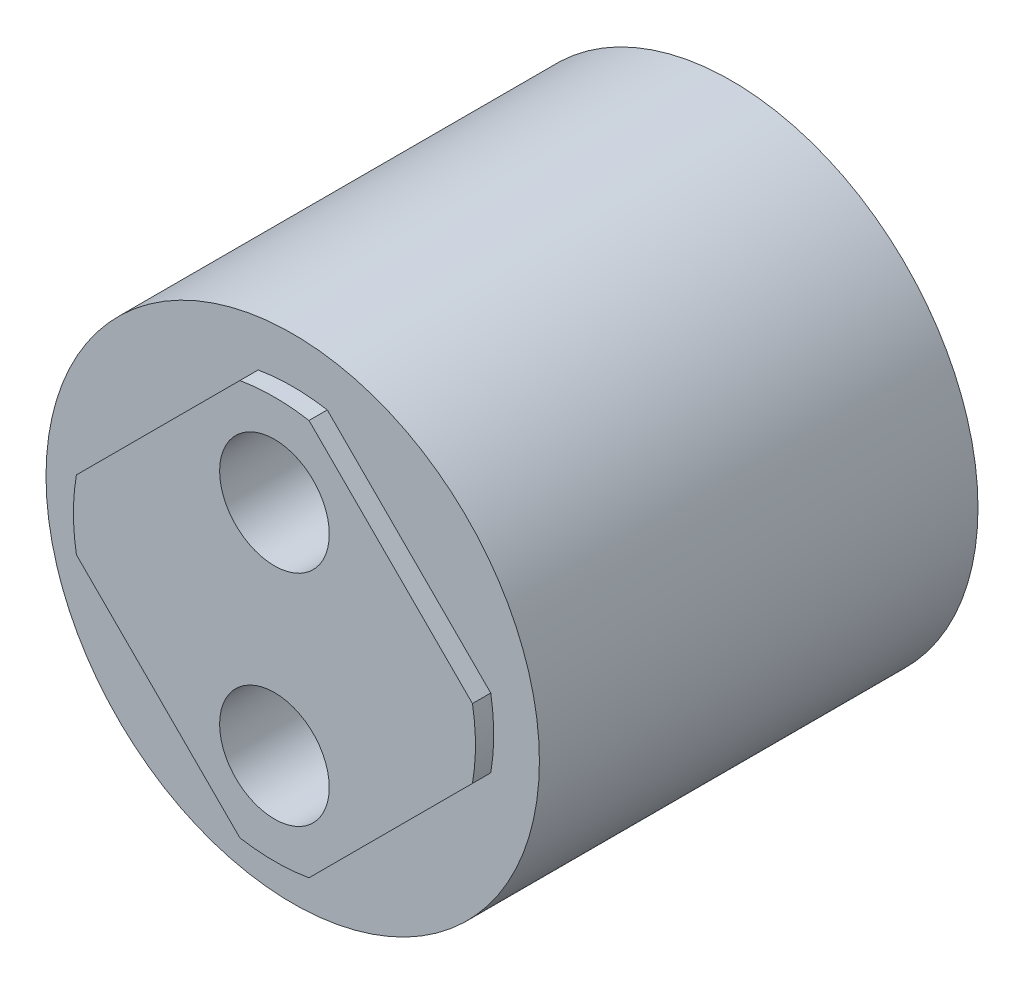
ISO-10303-21;
HEADER;
FILE_DESCRIPTION(('STEP AP214'),'2;1');
FILE_NAME('part.step','',(''),(''),'','','');
FILE_SCHEMA(('AUTOMOTIVE_DESIGN { 1 0 10303 214 1 1 1 1 }'));
ENDSEC;
DATA;
#1=APPLICATION_CONTEXT('core data for automotive mechanical design processes');
#2=APPLICATION_PROTOCOL_DEFINITION('international standard','automotive_design',2000,#1);
#3=PRODUCT_CONTEXT('',#1,'mechanical');
#4=PRODUCT('Part','Part','',(#3));
#5=PRODUCT_RELATED_PRODUCT_CATEGORY('part','',(#4));
#6=PRODUCT_DEFINITION_FORMATION('','',#4);
#7=PRODUCT_DEFINITION_CONTEXT('part definition',#1,'design');
#8=PRODUCT_DEFINITION('design','',#6,#7);
#9=PRODUCT_DEFINITION_SHAPE('','',#8);
#10=(LENGTH_UNIT() NAMED_UNIT(*) SI_UNIT(.MILLI.,.METRE.));
#11=(NAMED_UNIT(*) PLANE_ANGLE_UNIT() SI_UNIT($,.RADIAN.));
#12=(NAMED_UNIT(*) SI_UNIT($,.STERADIAN.) SOLID_ANGLE_UNIT());
#13=UNCERTAINTY_MEASURE_WITH_UNIT(LENGTH_MEASURE(1.E-05),#10,'distance_accuracy_value','');
#14=(GEOMETRIC_REPRESENTATION_CONTEXT(3) GLOBAL_UNCERTAINTY_ASSIGNED_CONTEXT((#13)) GLOBAL_UNIT_ASSIGNED_CONTEXT((#10,
#11,#12)) REPRESENTATION_CONTEXT('',''));
#15=CARTESIAN_POINT('',(0.,0.,0.));
#16=DIRECTION('',(0.,0.,1.));
#17=DIRECTION('',(1.,0.,0.));
#18=AXIS2_PLACEMENT_3D('',#15,#16,#17);
#19=CARTESIAN_POINT('',(0.,6.,24.));
#20=DIRECTION('',(0.,0.,-1.));
#21=DIRECTION('',(1.,0.,0.));
#22=AXIS2_PLACEMENT_3D('',#19,#20,#21);
#23=CYLINDRICAL_SURFACE('',#22,3.);
#24=CARTESIAN_POINT('',(0.,6.,25.));
#25=DIRECTION('',(0.,0.,1.));
#26=DIRECTION('',(-1.,0.,0.));
#27=AXIS2_PLACEMENT_3D('',#24,#25,#26);
#28=CIRCLE('',#27,3.);
#29=CARTESIAN_POINT('',(-3.,6.,25.));
#30=VERTEX_POINT('',#29);
#31=EDGE_CURVE('E165',#30,#30,#28,.T.);
#32=ORIENTED_EDGE('',*,*,#31,.T.);
#33=EDGE_LOOP('',(#32));
#34=FACE_BOUND('',#33,.T.);
#35=CARTESIAN_POINT('',(0.,6.,10.));
#36=DIRECTION('',(0.,0.,-1.));
#37=DIRECTION('',(1.,0.,0.));
#38=AXIS2_PLACEMENT_3D('',#35,#36,#37);
#39=CIRCLE('',#38,3.);
#40=CARTESIAN_POINT('',(3.,6.,10.));
#41=VERTEX_POINT('',#40);
#42=EDGE_CURVE('E9',#41,#41,#39,.F.);
#43=ORIENTED_EDGE('',*,*,#42,.F.);
#44=EDGE_LOOP('',(#43));
#45=FACE_BOUND('',#44,.T.);
#46=ADVANCED_FACE('F14',(#34,#45),#23,.F.);
#47=CARTESIAN_POINT('',(0.,-6.,24.));
#48=DIRECTION('',(0.,0.,-1.));
#49=DIRECTION('',(1.,0.,0.));
#50=AXIS2_PLACEMENT_3D('',#47,#48,#49);
#51=CYLINDRICAL_SURFACE('',#50,3.);
#52=CARTESIAN_POINT('',(0.,-6.,25.));
#53=DIRECTION('',(0.,0.,1.));
#54=DIRECTION('',(-1.,0.,0.));
#55=AXIS2_PLACEMENT_3D('',#52,#53,#54);
#56=CIRCLE('',#55,3.);
#57=CARTESIAN_POINT('',(-3.,-6.,25.));
#58=VERTEX_POINT('',#57);
#59=EDGE_CURVE('E161',#58,#58,#56,.T.);
#60=ORIENTED_EDGE('',*,*,#59,.T.);
#61=EDGE_LOOP('',(#60));
#62=FACE_BOUND('',#61,.T.);
#63=CARTESIAN_POINT('',(0.,-6.,10.));
#64=DIRECTION('',(0.,0.,-1.));
#65=DIRECTION('',(1.,0.,0.));
#66=AXIS2_PLACEMENT_3D('',#63,#64,#65);
#67=CIRCLE('',#66,3.);
#68=CARTESIAN_POINT('',(3.,-6.,10.));
#69=VERTEX_POINT('',#68);
#70=EDGE_CURVE('E24',#69,#69,#67,.F.);
#71=ORIENTED_EDGE('',*,*,#70,.F.);
#72=EDGE_LOOP('',(#71));
#73=FACE_BOUND('',#72,.T.);
#74=ADVANCED_FACE('F221',(#62,#73),#51,.F.);
#75=CARTESIAN_POINT('',(0.,0.,24.));
#76=DIRECTION('',(0.,0.,-1.));
#77=DIRECTION('',(1.,0.,0.));
#78=AXIS2_PLACEMENT_3D('',#75,#76,#77);
#79=CYLINDRICAL_SURFACE('',#78,13.5);
#80=CARTESIAN_POINT('',(0.,0.,0.));
#81=DIRECTION('',(0.,0.,-1.));
#82=DIRECTION('',(1.,0.,0.));
#83=AXIS2_PLACEMENT_3D('',#80,#81,#82);
#84=CIRCLE('',#83,13.5);
#85=CARTESIAN_POINT('',(13.5,0.,0.));
#86=VERTEX_POINT('',#85);
#87=EDGE_CURVE('E180',#86,#86,#84,.T.);
#88=ORIENTED_EDGE('',*,*,#87,.F.);
#89=EDGE_LOOP('',(#88));
#90=FACE_BOUND('',#89,.T.);
#91=CARTESIAN_POINT('',(0.,0.,24.));
#92=DIRECTION('',(0.,0.,1.));
#93=DIRECTION('',(-1.,0.,0.));
#94=AXIS2_PLACEMENT_3D('',#91,#92,#93);
#95=CIRCLE('',#94,13.5);
#96=CARTESIAN_POINT('',(-13.5,0.,24.));
#97=VERTEX_POINT('',#96);
#98=EDGE_CURVE('E157',#97,#97,#95,.T.);
#99=ORIENTED_EDGE('',*,*,#98,.F.);
#100=EDGE_LOOP('',(#99));
#101=FACE_BOUND('',#100,.T.);
#102=ADVANCED_FACE('F223',(#90,#101),#79,.T.);
#103=CARTESIAN_POINT('',(0.,0.,25.));
#104=DIRECTION('',(0.,0.,-1.));
#105=DIRECTION('',(1.,0.,0.));
#106=AXIS2_PLACEMENT_3D('',#103,#104,#105);
#107=CYLINDRICAL_SURFACE('',#106,11.);
#108=CARTESIAN_POINT('',(0.,0.,25.));
#109=DIRECTION('',(0.,0.,1.));
#110=DIRECTION('',(-1.,0.,0.));
#111=AXIS2_PLACEMENT_3D('',#108,#109,#110);
#112=CIRCLE('',#111,11.);
#113=CARTESIAN_POINT('',(10.8360969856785,-1.89182507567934,25.));
#114=VERTEX_POINT('',#113);
#115=CARTESIAN_POINT('',(10.8360969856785,1.89182507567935,25.));
#116=VERTEX_POINT('',#115);
#117=EDGE_CURVE('E178',#114,#116,#112,.T.);
#118=ORIENTED_EDGE('',*,*,#117,.F.);
#119=DIRECTION('',(0.,0.,-1.));
#120=VECTOR('',#119,1.);
#121=CARTESIAN_POINT('',(10.8360969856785,-1.89182507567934,25.));
#122=LINE('',#121,#120);
#123=CARTESIAN_POINT('',(10.8360969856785,-1.89182507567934,24.));
#124=VERTEX_POINT('',#123);
#125=EDGE_CURVE('E18',#114,#124,#122,.T.);
#126=ORIENTED_EDGE('',*,*,#125,.T.);
#127=CARTESIAN_POINT('',(0.,0.,24.));
#128=DIRECTION('',(0.,0.,1.));
#129=DIRECTION('',(-1.,0.,0.));
#130=AXIS2_PLACEMENT_3D('',#127,#128,#129);
#131=CIRCLE('',#130,11.);
#132=CARTESIAN_POINT('',(10.8360969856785,1.89182507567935,24.));
#133=VERTEX_POINT('',#132);
#134=EDGE_CURVE('E90',#124,#133,#131,.T.);
#135=ORIENTED_EDGE('',*,*,#134,.T.);
#136=DIRECTION('',(0.,0.,-1.));
#137=VECTOR('',#136,1.);
#138=CARTESIAN_POINT('',(10.8360969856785,1.89182507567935,25.));
#139=LINE('',#138,#137);
#140=EDGE_CURVE('E39',#116,#133,#139,.T.);
#141=ORIENTED_EDGE('',*,*,#140,.F.);
#142=EDGE_LOOP('',(#118,#126,#135,#141));
#143=FACE_BOUND('',#142,.T.);
#144=ADVANCED_FACE('F231',(#143),#107,.T.);
#145=CARTESIAN_POINT('',(0.,0.,24.));
#146=DIRECTION('',(0.,0.,1.));
#147=DIRECTION('',(0.,-1.,0.));
#148=AXIS2_PLACEMENT_3D('',#145,#146,#147);
#149=PLANE('',#148);
#150=ORIENTED_EDGE('',*,*,#98,.T.);
#151=EDGE_LOOP('',(#150));
#152=FACE_BOUND('',#151,.T.);
#153=CARTESIAN_POINT('',(0.,0.,24.));
#154=DIRECTION('',(0.,0.,1.));
#155=DIRECTION('',(-1.,0.,0.));
#156=AXIS2_PLACEMENT_3D('',#153,#154,#155);
#157=CIRCLE('',#156,11.);
#158=CARTESIAN_POINT('',(1.89182507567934,10.8360969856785,24.));
#159=VERTEX_POINT('',#158);
#160=CARTESIAN_POINT('',(-1.89182507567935,10.8360969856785,24.));
#161=VERTEX_POINT('',#160);
#162=EDGE_CURVE('E151',#159,#161,#157,.T.);
#163=ORIENTED_EDGE('',*,*,#162,.F.);
#164=DIRECTION('',(-0.707106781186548,0.707106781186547,0.));
#165=VECTOR('',#164,1.);
#166=CARTESIAN_POINT('',(10.8360969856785,1.89182507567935,24.));
#167=LINE('',#166,#165);
#168=EDGE_CURVE('E80',#133,#159,#167,.T.);
#169=ORIENTED_EDGE('',*,*,#168,.F.);
#170=ORIENTED_EDGE('',*,*,#134,.F.);
#171=DIRECTION('',(0.707106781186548,0.707106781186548,0.));
#172=VECTOR('',#171,1.);
#173=CARTESIAN_POINT('',(1.89182507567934,-10.8360969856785,24.));
#174=LINE('',#173,#172);
#175=CARTESIAN_POINT('',(1.89182507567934,-10.8360969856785,24.));
#176=VERTEX_POINT('',#175);
#177=EDGE_CURVE('E111',#176,#124,#174,.T.);
#178=ORIENTED_EDGE('',*,*,#177,.F.);
#179=CARTESIAN_POINT('',(0.,0.,24.));
#180=DIRECTION('',(0.,0.,1.));
#181=DIRECTION('',(-1.,0.,0.));
#182=AXIS2_PLACEMENT_3D('',#179,#180,#181);
#183=CIRCLE('',#182,11.);
#184=CARTESIAN_POINT('',(-1.89182507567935,-10.8360969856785,24.));
#185=VERTEX_POINT('',#184);
#186=EDGE_CURVE('E109',#185,#176,#183,.T.);
#187=ORIENTED_EDGE('',*,*,#186,.F.);
#188=DIRECTION('',(0.707106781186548,-0.707106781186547,0.));
#189=VECTOR('',#188,1.);
#190=CARTESIAN_POINT('',(-10.8360969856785,-1.89182507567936,24.));
#191=LINE('',#190,#189);
#192=CARTESIAN_POINT('',(-10.8360969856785,-1.89182507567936,24.));
#193=VERTEX_POINT('',#192);
#194=EDGE_CURVE('E103',#193,#185,#191,.T.);
#195=ORIENTED_EDGE('',*,*,#194,.F.);
#196=CARTESIAN_POINT('',(0.,0.,24.));
#197=DIRECTION('',(0.,0.,1.));
#198=DIRECTION('',(-1.,0.,0.));
#199=AXIS2_PLACEMENT_3D('',#196,#197,#198);
#200=CIRCLE('',#199,11.);
#201=CARTESIAN_POINT('',(-10.8360969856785,1.89182507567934,24.));
#202=VERTEX_POINT('',#201);
#203=EDGE_CURVE('E166',#202,#193,#200,.T.);
#204=ORIENTED_EDGE('',*,*,#203,.F.);
#205=DIRECTION('',(-0.707106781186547,-0.707106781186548,0.));
#206=VECTOR('',#205,1.);
#207=CARTESIAN_POINT('',(-1.89182507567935,10.8360969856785,24.));
#208=LINE('',#207,#206);
#209=EDGE_CURVE('E152',#161,#202,#208,.T.);
#210=ORIENTED_EDGE('',*,*,#209,.F.);
#211=EDGE_LOOP('',(#163,#169,#170,#178,#187,#195,#204,#210));
#212=FACE_BOUND('',#211,.T.);
#213=ADVANCED_FACE('F110',(#152,#212),#149,.T.);
#214=CARTESIAN_POINT('',(0.,0.,25.));
#215=DIRECTION('',(0.,0.,1.));
#216=DIRECTION('',(0.,-1.,0.));
#217=AXIS2_PLACEMENT_3D('',#214,#215,#216);
#218=PLANE('',#217);
#219=CARTESIAN_POINT('',(0.,0.,25.));
#220=DIRECTION('',(0.,0.,1.));
#221=DIRECTION('',(-1.,0.,0.));
#222=AXIS2_PLACEMENT_3D('',#219,#220,#221);
#223=CIRCLE('',#222,11.);
#224=CARTESIAN_POINT('',(1.89182507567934,10.8360969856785,25.));
#225=VERTEX_POINT('',#224);
#226=CARTESIAN_POINT('',(-1.89182507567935,10.8360969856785,25.));
#227=VERTEX_POINT('',#226);
#228=EDGE_CURVE('E162',#225,#227,#223,.T.);
#229=ORIENTED_EDGE('',*,*,#228,.T.);
#230=DIRECTION('',(-0.707106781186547,-0.707106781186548,0.));
#231=VECTOR('',#230,1.);
#232=CARTESIAN_POINT('',(-1.89182507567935,10.8360969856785,25.));
#233=LINE('',#232,#231);
#234=CARTESIAN_POINT('',(-10.8360969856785,1.89182507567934,25.));
#235=VERTEX_POINT('',#234);
#236=EDGE_CURVE('E202',#227,#235,#233,.T.);
#237=ORIENTED_EDGE('',*,*,#236,.T.);
#238=CARTESIAN_POINT('',(0.,0.,25.));
#239=DIRECTION('',(0.,0.,1.));
#240=DIRECTION('',(-1.,0.,0.));
#241=AXIS2_PLACEMENT_3D('',#238,#239,#240);
#242=CIRCLE('',#241,11.);
#243=CARTESIAN_POINT('',(-10.8360969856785,-1.89182507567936,25.));
#244=VERTEX_POINT('',#243);
#245=EDGE_CURVE('E189',#235,#244,#242,.T.);
#246=ORIENTED_EDGE('',*,*,#245,.T.);
#247=DIRECTION('',(0.707106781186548,-0.707106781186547,0.));
#248=VECTOR('',#247,1.);
#249=CARTESIAN_POINT('',(-10.8360969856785,-1.89182507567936,25.));
#250=LINE('',#249,#248);
#251=CARTESIAN_POINT('',(-1.89182507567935,-10.8360969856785,25.));
#252=VERTEX_POINT('',#251);
#253=EDGE_CURVE('E145',#244,#252,#250,.T.);
#254=ORIENTED_EDGE('',*,*,#253,.T.);
#255=CARTESIAN_POINT('',(0.,0.,25.));
#256=DIRECTION('',(0.,0.,1.));
#257=DIRECTION('',(-1.,0.,0.));
#258=AXIS2_PLACEMENT_3D('',#255,#256,#257);
#259=CIRCLE('',#258,11.);
#260=CARTESIAN_POINT('',(1.89182507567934,-10.8360969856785,25.));
#261=VERTEX_POINT('',#260);
#262=EDGE_CURVE('E131',#252,#261,#259,.T.);
#263=ORIENTED_EDGE('',*,*,#262,.T.);
#264=DIRECTION('',(0.707106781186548,0.707106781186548,0.));
#265=VECTOR('',#264,1.);
#266=CARTESIAN_POINT('',(1.89182507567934,-10.8360969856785,25.));
#267=LINE('',#266,#265);
#268=EDGE_CURVE('E146',#261,#114,#267,.T.);
#269=ORIENTED_EDGE('',*,*,#268,.T.);
#270=ORIENTED_EDGE('',*,*,#117,.T.);
#271=DIRECTION('',(-0.707106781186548,0.707106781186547,0.));
#272=VECTOR('',#271,1.);
#273=CARTESIAN_POINT('',(10.8360969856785,1.89182507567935,25.));
#274=LINE('',#273,#272);
#275=EDGE_CURVE('E156',#116,#225,#274,.T.);
#276=ORIENTED_EDGE('',*,*,#275,.T.);
#277=EDGE_LOOP('',(#229,#237,#246,#254,#263,#269,#270,#276));
#278=FACE_BOUND('',#277,.T.);
#279=ORIENTED_EDGE('',*,*,#31,.F.);
#280=EDGE_LOOP('',(#279));
#281=FACE_BOUND('',#280,.T.);
#282=ORIENTED_EDGE('',*,*,#59,.F.);
#283=EDGE_LOOP('',(#282));
#284=FACE_BOUND('',#283,.T.);
#285=ADVANCED_FACE('F241',(#278,#281,#284),#218,.T.);
#286=CARTESIAN_POINT('',(0.,0.,25.));
#287=DIRECTION('',(0.,0.,-1.));
#288=DIRECTION('',(1.,0.,0.));
#289=AXIS2_PLACEMENT_3D('',#286,#287,#288);
#290=CYLINDRICAL_SURFACE('',#289,11.);
#291=ORIENTED_EDGE('',*,*,#162,.T.);
#292=DIRECTION('',(0.,0.,-1.));
#293=VECTOR('',#292,1.);
#294=CARTESIAN_POINT('',(-1.89182507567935,10.8360969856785,25.));
#295=LINE('',#294,#293);
#296=EDGE_CURVE('E169',#227,#161,#295,.T.);
#297=ORIENTED_EDGE('',*,*,#296,.F.);
#298=ORIENTED_EDGE('',*,*,#228,.F.);
#299=DIRECTION('',(0.,0.,-1.));
#300=VECTOR('',#299,1.);
#301=CARTESIAN_POINT('',(1.89182507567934,10.8360969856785,25.));
#302=LINE('',#301,#300);
#303=EDGE_CURVE('E147',#225,#159,#302,.T.);
#304=ORIENTED_EDGE('',*,*,#303,.T.);
#305=EDGE_LOOP('',(#291,#297,#298,#304));
#306=FACE_BOUND('',#305,.T.);
#307=ADVANCED_FACE('F244',(#306),#290,.T.);
#308=CARTESIAN_POINT('',(-1.89182507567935,10.8360969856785,25.));
#309=DIRECTION('',(0.707106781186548,-0.707106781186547,0.));
#310=DIRECTION('',(0.,0.,-1.));
#311=AXIS2_PLACEMENT_3D('',#308,#309,#310);
#312=PLANE('',#311);
#313=ORIENTED_EDGE('',*,*,#209,.T.);
#314=DIRECTION('',(0.,0.,-1.));
#315=VECTOR('',#314,1.);
#316=CARTESIAN_POINT('',(-10.8360969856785,1.89182507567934,25.));
#317=LINE('',#316,#315);
#318=EDGE_CURVE('E126',#235,#202,#317,.T.);
#319=ORIENTED_EDGE('',*,*,#318,.F.);
#320=ORIENTED_EDGE('',*,*,#236,.F.);
#321=ORIENTED_EDGE('',*,*,#296,.T.);
#322=EDGE_LOOP('',(#313,#319,#320,#321));
#323=FACE_BOUND('',#322,.T.);
#324=ADVANCED_FACE('F16',(#323),#312,.F.);
#325=CARTESIAN_POINT('',(0.,0.,25.));
#326=DIRECTION('',(0.,0.,-1.));
#327=DIRECTION('',(1.,0.,0.));
#328=AXIS2_PLACEMENT_3D('',#325,#326,#327);
#329=CYLINDRICAL_SURFACE('',#328,11.);
#330=ORIENTED_EDGE('',*,*,#203,.T.);
#331=DIRECTION('',(0.,0.,-1.));
#332=VECTOR('',#331,1.);
#333=CARTESIAN_POINT('',(-10.8360969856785,-1.89182507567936,25.));
#334=LINE('',#333,#332);
#335=EDGE_CURVE('E117',#244,#193,#334,.T.);
#336=ORIENTED_EDGE('',*,*,#335,.F.);
#337=ORIENTED_EDGE('',*,*,#245,.F.);
#338=ORIENTED_EDGE('',*,*,#318,.T.);
#339=EDGE_LOOP('',(#330,#336,#337,#338));
#340=FACE_BOUND('',#339,.T.);
#341=ADVANCED_FACE('F239',(#340),#329,.T.);
#342=CARTESIAN_POINT('',(-10.8360969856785,-1.89182507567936,25.));
#343=DIRECTION('',(0.707106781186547,0.707106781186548,0.));
#344=DIRECTION('',(-0.707106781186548,0.707106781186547,0.));
#345=AXIS2_PLACEMENT_3D('',#342,#343,#344);
#346=PLANE('',#345);
#347=ORIENTED_EDGE('',*,*,#194,.T.);
#348=DIRECTION('',(0.,0.,-1.));
#349=VECTOR('',#348,1.);
#350=CARTESIAN_POINT('',(-1.89182507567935,-10.8360969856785,25.));
#351=LINE('',#350,#349);
#352=EDGE_CURVE('E118',#252,#185,#351,.T.);
#353=ORIENTED_EDGE('',*,*,#352,.F.);
#354=ORIENTED_EDGE('',*,*,#253,.F.);
#355=ORIENTED_EDGE('',*,*,#335,.T.);
#356=EDGE_LOOP('',(#347,#353,#354,#355));
#357=FACE_BOUND('',#356,.T.);
#358=ADVANCED_FACE('F123',(#357),#346,.F.);
#359=CARTESIAN_POINT('',(0.,0.,25.));
#360=DIRECTION('',(0.,0.,-1.));
#361=DIRECTION('',(1.,0.,0.));
#362=AXIS2_PLACEMENT_3D('',#359,#360,#361);
#363=CYLINDRICAL_SURFACE('',#362,11.);
#364=ORIENTED_EDGE('',*,*,#186,.T.);
#365=DIRECTION('',(0.,0.,-1.));
#366=VECTOR('',#365,1.);
#367=CARTESIAN_POINT('',(1.89182507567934,-10.8360969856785,25.));
#368=LINE('',#367,#366);
#369=EDGE_CURVE('E139',#261,#176,#368,.T.);
#370=ORIENTED_EDGE('',*,*,#369,.F.);
#371=ORIENTED_EDGE('',*,*,#262,.F.);
#372=ORIENTED_EDGE('',*,*,#352,.T.);
#373=EDGE_LOOP('',(#364,#370,#371,#372));
#374=FACE_BOUND('',#373,.T.);
#375=ADVANCED_FACE('F129',(#374),#363,.T.);
#376=CARTESIAN_POINT('',(1.89182507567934,-10.8360969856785,25.));
#377=DIRECTION('',(-0.707106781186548,0.707106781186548,0.));
#378=DIRECTION('',(0.,0.,1.));
#379=AXIS2_PLACEMENT_3D('',#376,#377,#378);
#380=PLANE('',#379);
#381=ORIENTED_EDGE('',*,*,#177,.T.);
#382=ORIENTED_EDGE('',*,*,#125,.F.);
#383=ORIENTED_EDGE('',*,*,#268,.F.);
#384=ORIENTED_EDGE('',*,*,#369,.T.);
#385=EDGE_LOOP('',(#381,#382,#383,#384));
#386=FACE_BOUND('',#385,.T.);
#387=ADVANCED_FACE('F255',(#386),#380,.F.);
#388=CARTESIAN_POINT('',(10.8360969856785,1.89182507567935,25.));
#389=DIRECTION('',(-0.707106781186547,-0.707106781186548,0.));
#390=DIRECTION('',(0.,0.,-1.));
#391=AXIS2_PLACEMENT_3D('',#388,#389,#390);
#392=PLANE('',#391);
#393=ORIENTED_EDGE('',*,*,#168,.T.);
#394=ORIENTED_EDGE('',*,*,#303,.F.);
#395=ORIENTED_EDGE('',*,*,#275,.F.);
#396=ORIENTED_EDGE('',*,*,#140,.T.);
#397=EDGE_LOOP('',(#393,#394,#395,#396));
#398=FACE_BOUND('',#397,.T.);
#399=ADVANCED_FACE('F251',(#398),#392,.F.);
#400=CARTESIAN_POINT('',(0.,0.,0.));
#401=DIRECTION('',(0.,0.,-1.));
#402=DIRECTION('',(1.,0.,0.));
#403=AXIS2_PLACEMENT_3D('',#400,#401,#402);
#404=PLANE('',#403);
#405=ORIENTED_EDGE('',*,*,#87,.T.);
#406=EDGE_LOOP('',(#405));
#407=FACE_BOUND('',#406,.T.);
#408=ADVANCED_FACE('F254',(#407),#404,.T.);
#409=CARTESIAN_POINT('',(0.,0.,10.));
#410=DIRECTION('',(0.,0.,-1.));
#411=DIRECTION('',(1.,0.,0.));
#412=AXIS2_PLACEMENT_3D('',#409,#410,#411);
#413=PLANE('',#412);
#414=ORIENTED_EDGE('',*,*,#70,.T.);
#415=EDGE_LOOP('',(#414));
#416=FACE_BOUND('',#415,.T.);
#417=ADVANCED_FACE('F219',(#416),#413,.F.);
#418=ORIENTED_EDGE('',*,*,#42,.T.);
#419=EDGE_LOOP('',(#418));
#420=FACE_BOUND('',#419,.T.);
#421=ADVANCED_FACE('F270',(#420),#413,.F.);
#422=CLOSED_SHELL('',(#46,#74,#102,#144,#213,#285,#307,#324,#341,#358,#375,#387,#399,#408,#417,#421));
#423=MANIFOLD_SOLID_BREP('B1',#422);
#424=ADVANCED_BREP_SHAPE_REPRESENTATION('',(#18,#423),#14);
#425=SHAPE_DEFINITION_REPRESENTATION(#9,#424);
ENDSEC;
END-ISO-10303-21;
